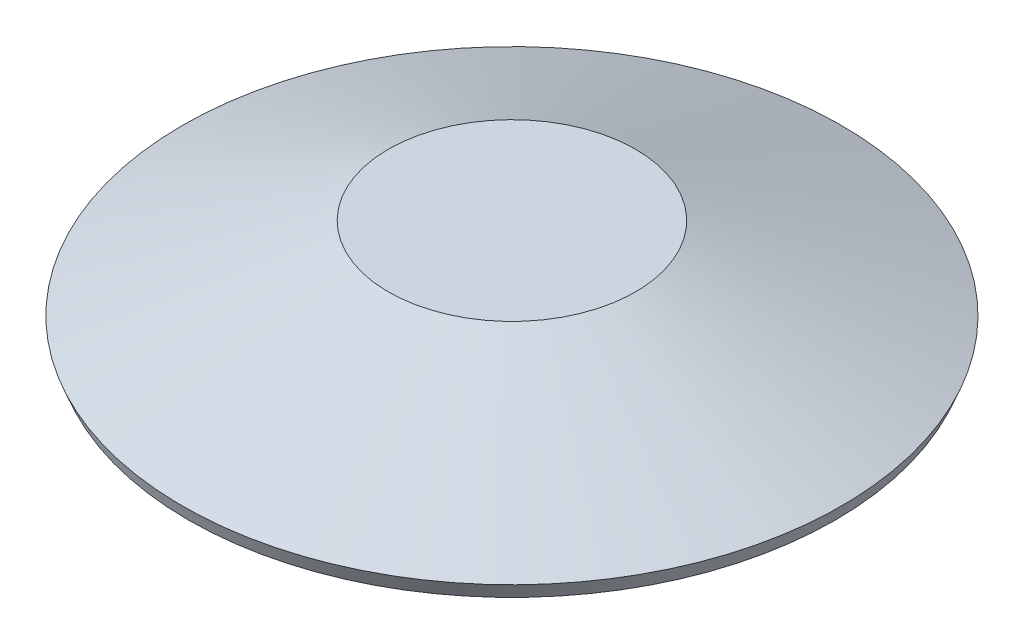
ISO-10303-21;
HEADER;
FILE_DESCRIPTION(('STEP AP214'),'2;1');
FILE_NAME('part.step','',(''),(''),'','','');
FILE_SCHEMA(('AUTOMOTIVE_DESIGN { 1 0 10303 214 1 1 1 1 }'));
ENDSEC;
DATA;
#1=APPLICATION_CONTEXT('core data for automotive mechanical design processes');
#2=APPLICATION_PROTOCOL_DEFINITION('international standard','automotive_design',2000,#1);
#3=PRODUCT_CONTEXT('',#1,'mechanical');
#4=PRODUCT('Part','Part','',(#3));
#5=PRODUCT_RELATED_PRODUCT_CATEGORY('part','',(#4));
#6=PRODUCT_DEFINITION_FORMATION('','',#4);
#7=PRODUCT_DEFINITION_CONTEXT('part definition',#1,'design');
#8=PRODUCT_DEFINITION('design','',#6,#7);
#9=PRODUCT_DEFINITION_SHAPE('','',#8);
#10=(LENGTH_UNIT() NAMED_UNIT(*) SI_UNIT(.MILLI.,.METRE.));
#11=(NAMED_UNIT(*) PLANE_ANGLE_UNIT() SI_UNIT($,.RADIAN.));
#12=(NAMED_UNIT(*) SI_UNIT($,.STERADIAN.) SOLID_ANGLE_UNIT());
#13=UNCERTAINTY_MEASURE_WITH_UNIT(LENGTH_MEASURE(1.E-05),#10,'distance_accuracy_value','');
#14=(GEOMETRIC_REPRESENTATION_CONTEXT(3) GLOBAL_UNCERTAINTY_ASSIGNED_CONTEXT((#13)) GLOBAL_UNIT_ASSIGNED_CONTEXT((#10,
#11,#12)) REPRESENTATION_CONTEXT('',''));
#15=CARTESIAN_POINT('',(0.,0.,0.));
#16=DIRECTION('',(0.,0.,1.));
#17=DIRECTION('',(1.,0.,0.));
#18=AXIS2_PLACEMENT_3D('',#15,#16,#17);
#19=CARTESIAN_POINT('',(0.,1.6,0.));
#20=DIRECTION('',(0.,-1.,0.));
#21=DIRECTION('',(1.,0.,0.));
#22=AXIS2_PLACEMENT_3D('',#19,#20,#21);
#23=PLANE('',#22);
#24=CARTESIAN_POINT('',(0.,1.6,0.));
#25=DIRECTION('',(0.,1.,0.));
#26=DIRECTION('',(-1.,0.,0.));
#27=AXIS2_PLACEMENT_3D('',#24,#25,#26);
#28=CIRCLE('',#27,3.);
#29=CARTESIAN_POINT('',(-3.,1.6,0.));
#30=VERTEX_POINT('',#29);
#31=EDGE_CURVE('E75',#30,#30,#28,.T.);
#32=ORIENTED_EDGE('',*,*,#31,.T.);
#33=EDGE_LOOP('',(#32));
#34=FACE_BOUND('',#33,.T.);
#35=ADVANCED_FACE('F41',(#34),#23,.F.);
#36=CARTESIAN_POINT('',(0.,-3.7,0.));
#37=DIRECTION('',(0.,1.,0.));
#38=DIRECTION('',(-1.,0.,0.));
#39=AXIS2_PLACEMENT_3D('',#36,#37,#38);
#40=PLANE('',#39);
#41=CARTESIAN_POINT('',(0.,-3.7,0.));
#42=DIRECTION('',(0.,1.,0.));
#43=DIRECTION('',(-1.,0.,0.));
#44=AXIS2_PLACEMENT_3D('',#41,#42,#43);
#45=CIRCLE('',#44,1.);
#46=CARTESIAN_POINT('',(-1.,-3.7,0.));
#47=VERTEX_POINT('',#46);
#48=EDGE_CURVE('E10',#47,#47,#45,.T.);
#49=ORIENTED_EDGE('',*,*,#48,.F.);
#50=EDGE_LOOP('',(#49));
#51=FACE_BOUND('',#50,.T.);
#52=ADVANCED_FACE('F129',(#51),#40,.F.);
#53=CARTESIAN_POINT('',(0.,-0.155918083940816,0.));
#54=DIRECTION('',(0.,1.,0.));
#55=DIRECTION('',(-1.,0.,0.));
#56=AXIS2_PLACEMENT_3D('',#53,#54,#55);
#57=CYLINDRICAL_SURFACE('',#56,1.);
#58=CARTESIAN_POINT('',(0.,-3.3,0.));
#59=DIRECTION('',(0.,1.,0.));
#60=DIRECTION('',(-1.,0.,0.));
#61=AXIS2_PLACEMENT_3D('',#58,#59,#60);
#62=CIRCLE('',#61,1.);
#63=CARTESIAN_POINT('',(-1.,-3.3,0.));
#64=VERTEX_POINT('',#63);
#65=EDGE_CURVE('E47',#64,#64,#62,.T.);
#66=ORIENTED_EDGE('',*,*,#65,.F.);
#67=EDGE_LOOP('',(#66));
#68=FACE_BOUND('',#67,.T.);
#69=ORIENTED_EDGE('',*,*,#48,.T.);
#70=EDGE_LOOP('',(#69));
#71=FACE_BOUND('',#70,.T.);
#72=ADVANCED_FACE('F124',(#68,#71),#57,.T.);
#73=CARTESIAN_POINT('',(0.,-3.3,0.));
#74=DIRECTION('',(0.,1.,0.));
#75=DIRECTION('',(-1.,0.,0.));
#76=AXIS2_PLACEMENT_3D('',#73,#74,#75);
#77=CONICAL_SURFACE('',#76,1.,0.917970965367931);
#78=CARTESIAN_POINT('',(0.,-2.66296644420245,0.));
#79=DIRECTION('',(0.,1.,0.));
#80=DIRECTION('',(-1.,0.,0.));
#81=AXIS2_PLACEMENT_3D('',#78,#79,#80);
#82=CIRCLE('',#81,1.83308060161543);
#83=CARTESIAN_POINT('',(-1.83308060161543,-2.66296644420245,0.));
#84=VERTEX_POINT('',#83);
#85=EDGE_CURVE('E51',#84,#84,#82,.T.);
#86=ORIENTED_EDGE('',*,*,#85,.F.);
#87=EDGE_LOOP('',(#86));
#88=FACE_BOUND('',#87,.T.);
#89=ORIENTED_EDGE('',*,*,#65,.T.);
#90=EDGE_LOOP('',(#89));
#91=FACE_BOUND('',#90,.T.);
#92=ADVANCED_FACE('F119',(#88,#91),#77,.T.);
#93=CARTESIAN_POINT('',(0.,-2.3252,0.));
#94=DIRECTION('',(0.,1.,0.));
#95=DIRECTION('',(-1.,0.,0.));
#96=AXIS2_PLACEMENT_3D('',#93,#94,#95);
#97=TOROIDAL_SURFACE('',#96,1.5748,0.4252);
#98=CARTESIAN_POINT('',(0.,-1.9,0.));
#99=DIRECTION('',(0.,1.,0.));
#100=DIRECTION('',(-1.,0.,0.));
#101=AXIS2_PLACEMENT_3D('',#98,#99,#100);
#102=CIRCLE('',#101,1.5748);
#103=CARTESIAN_POINT('',(-1.5748,-1.9,0.));
#104=VERTEX_POINT('',#103);
#105=EDGE_CURVE('E55',#104,#104,#102,.T.);
#106=ORIENTED_EDGE('',*,*,#105,.F.);
#107=EDGE_LOOP('',(#106));
#108=FACE_BOUND('',#107,.T.);
#109=ORIENTED_EDGE('',*,*,#85,.T.);
#110=EDGE_LOOP('',(#109));
#111=FACE_BOUND('',#110,.T.);
#112=ADVANCED_FACE('F113',(#108,#111),#97,.T.);
#113=CARTESIAN_POINT('',(0.,-1.9,0.));
#114=DIRECTION('',(0.,1.,0.));
#115=DIRECTION('',(-1.,0.,0.));
#116=AXIS2_PLACEMENT_3D('',#113,#114,#115);
#117=CONICAL_SURFACE('',#116,1.5748,0.152542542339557);
#118=CARTESIAN_POINT('',(0.,0.,0.));
#119=DIRECTION('',(0.,1.,0.));
#120=DIRECTION('',(-1.,0.,0.));
#121=AXIS2_PLACEMENT_3D('',#118,#119,#120);
#122=CIRCLE('',#121,1.8669);
#123=CARTESIAN_POINT('',(-1.8669,0.,0.));
#124=VERTEX_POINT('',#123);
#125=EDGE_CURVE('E60',#124,#124,#122,.T.);
#126=ORIENTED_EDGE('',*,*,#125,.F.);
#127=EDGE_LOOP('',(#126));
#128=FACE_BOUND('',#127,.T.);
#129=ORIENTED_EDGE('',*,*,#105,.T.);
#130=EDGE_LOOP('',(#129));
#131=FACE_BOUND('',#130,.T.);
#132=ADVANCED_FACE('F107',(#128,#131),#117,.T.);
#133=CARTESIAN_POINT('',(2.5,0.,0.));
#134=DIRECTION('',(0.,1.,0.));
#135=DIRECTION('',(-1.,0.,0.));
#136=AXIS2_PLACEMENT_3D('',#133,#134,#135);
#137=PLANE('',#136);
#138=CARTESIAN_POINT('',(0.,0.,0.));
#139=DIRECTION('',(0.,1.,0.));
#140=DIRECTION('',(-1.,0.,0.));
#141=AXIS2_PLACEMENT_3D('',#138,#139,#140);
#142=CIRCLE('',#141,2.5);
#143=CARTESIAN_POINT('',(-2.5,0.,0.));
#144=VERTEX_POINT('',#143);
#145=EDGE_CURVE('E63',#144,#144,#142,.T.);
#146=ORIENTED_EDGE('',*,*,#145,.F.);
#147=EDGE_LOOP('',(#146));
#148=FACE_BOUND('',#147,.T.);
#149=ORIENTED_EDGE('',*,*,#125,.T.);
#150=EDGE_LOOP('',(#149));
#151=FACE_BOUND('',#150,.T.);
#152=ADVANCED_FACE('F101',(#148,#151),#137,.F.);
#153=CARTESIAN_POINT('',(0.,-0.155918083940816,0.));
#154=DIRECTION('',(0.,1.,0.));
#155=DIRECTION('',(-1.,0.,0.));
#156=AXIS2_PLACEMENT_3D('',#153,#154,#155);
#157=CYLINDRICAL_SURFACE('',#156,2.5);
#158=CARTESIAN_POINT('',(0.,0.5,0.));
#159=DIRECTION('',(0.,1.,0.));
#160=DIRECTION('',(-1.,0.,0.));
#161=AXIS2_PLACEMENT_3D('',#158,#159,#160);
#162=CIRCLE('',#161,2.5);
#163=CARTESIAN_POINT('',(2.5,0.5,0.));
#164=VERTEX_POINT('',#163);
#165=EDGE_CURVE('E66',#164,#164,#162,.T.);
#166=ORIENTED_EDGE('',*,*,#165,.F.);
#167=EDGE_LOOP('',(#166));
#168=FACE_BOUND('',#167,.T.);
#169=ORIENTED_EDGE('',*,*,#145,.T.);
#170=EDGE_LOOP('',(#169));
#171=FACE_BOUND('',#170,.T.);
#172=ADVANCED_FACE('F95',(#168,#171),#157,.T.);
#173=CARTESIAN_POINT('',(0.,0.5,0.));
#174=DIRECTION('',(0.,-1.,0.));
#175=DIRECTION('',(1.,0.,0.));
#176=AXIS2_PLACEMENT_3D('',#173,#174,#175);
#177=CONICAL_SURFACE('',#176,2.5,1.33754174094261);
#178=CARTESIAN_POINT('',(0.,-0.771390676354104,0.));
#179=DIRECTION('',(0.,1.,0.));
#180=DIRECTION('',(-1.,0.,0.));
#181=AXIS2_PLACEMENT_3D('',#178,#179,#180);
#182=CIRCLE('',#181,7.85144372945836);
#183=CARTESIAN_POINT('',(7.85144372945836,-0.771390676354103,0.));
#184=VERTEX_POINT('',#183);
#185=EDGE_CURVE('E69',#184,#184,#182,.T.);
#186=CARTESIAN_POINT('',(7.85144372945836,-0.771390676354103,0.));
#187=CARTESIAN_POINT('',(7.79569952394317,-0.758147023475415,0.));
#188=CARTESIAN_POINT('',(7.73995531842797,-0.744903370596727,0.));
#189=CARTESIAN_POINT('',(7.62846690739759,-0.718416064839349,0.));
#190=CARTESIAN_POINT('',(7.5727227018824,-0.70517241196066,0.));
#191=CARTESIAN_POINT('',(7.46123429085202,-0.678685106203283,0.));
#192=CARTESIAN_POINT('',(7.40549008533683,-0.665441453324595,0.));
#193=CARTESIAN_POINT('',(7.29400167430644,-0.638954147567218,0.));
#194=CARTESIAN_POINT('',(7.23825746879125,-0.625710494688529,0.));
#195=CARTESIAN_POINT('',(7.12676905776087,-0.599223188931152,0.));
#196=CARTESIAN_POINT('',(7.07102485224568,-0.585979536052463,0.));
#197=CARTESIAN_POINT('',(6.9595364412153,-0.559492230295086,0.));
#198=CARTESIAN_POINT('',(6.90379223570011,-0.546248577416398,0.));
#199=CARTESIAN_POINT('',(6.79230382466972,-0.51976127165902,0.));
#200=CARTESIAN_POINT('',(6.73655961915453,-0.506517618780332,0.));
#201=CARTESIAN_POINT('',(6.62507120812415,-0.480030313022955,0.));
#202=CARTESIAN_POINT('',(6.56932700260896,-0.466786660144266,0.));
#203=CARTESIAN_POINT('',(6.45783859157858,-0.440299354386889,0.));
#204=CARTESIAN_POINT('',(6.40209438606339,-0.4270557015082,0.));
#205=CARTESIAN_POINT('',(6.290605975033,-0.400568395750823,0.));
#206=CARTESIAN_POINT('',(6.23486176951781,-0.387324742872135,0.));
#207=CARTESIAN_POINT('',(6.12337335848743,-0.360837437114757,0.));
#208=CARTESIAN_POINT('',(6.06762915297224,-0.347593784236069,0.));
#209=CARTESIAN_POINT('',(5.95614074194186,-0.321106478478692,0.));
#210=CARTESIAN_POINT('',(5.90039653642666,-0.307862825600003,0.));
#211=CARTESIAN_POINT('',(5.78890812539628,-0.281375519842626,0.));
#212=CARTESIAN_POINT('',(5.73316391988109,-0.268131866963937,0.));
#213=CARTESIAN_POINT('',(5.62167550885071,-0.24164456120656,0.));
#214=CARTESIAN_POINT('',(5.56593130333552,-0.228400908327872,0.));
#215=CARTESIAN_POINT('',(5.45444289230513,-0.201913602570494,0.));
#216=CARTESIAN_POINT('',(5.39869868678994,-0.188669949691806,0.));
#217=CARTESIAN_POINT('',(5.28721027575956,-0.162182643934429,0.));
#218=CARTESIAN_POINT('',(5.23146607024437,-0.14893899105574,0.));
#219=CARTESIAN_POINT('',(5.11997765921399,-0.122451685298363,0.));
#220=CARTESIAN_POINT('',(5.0642334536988,-0.109208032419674,0.));
#221=CARTESIAN_POINT('',(4.95274504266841,-0.0827207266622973,0.));
#222=CARTESIAN_POINT('',(4.89700083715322,-0.0694770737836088,0.));
#223=CARTESIAN_POINT('',(4.78551242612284,-0.0429897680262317,0.));
#224=CARTESIAN_POINT('',(4.72976822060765,-0.0297461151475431,0.));
#225=CARTESIAN_POINT('',(4.61827980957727,-0.00325880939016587,0.));
#226=CARTESIAN_POINT('',(4.56253560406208,0.00998484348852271,0.));
#227=CARTESIAN_POINT('',(4.45104719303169,0.0364721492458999,0.));
#228=CARTESIAN_POINT('',(4.3953029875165,0.0497158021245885,0.));
#229=CARTESIAN_POINT('',(4.28381457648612,0.0762031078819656,0.));
#230=CARTESIAN_POINT('',(4.22807037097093,0.0894467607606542,0.));
#231=CARTESIAN_POINT('',(4.11658195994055,0.115934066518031,0.));
#232=CARTESIAN_POINT('',(4.06083775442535,0.12917771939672,0.));
#233=CARTESIAN_POINT('',(3.94934934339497,0.155665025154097,0.));
#234=CARTESIAN_POINT('',(3.89360513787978,0.168908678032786,0.));
#235=CARTESIAN_POINT('',(3.7821167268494,0.195395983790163,0.));
#236=CARTESIAN_POINT('',(3.72637252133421,0.208639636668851,0.));
#237=CARTESIAN_POINT('',(3.61488411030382,0.235126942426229,0.));
#238=CARTESIAN_POINT('',(3.55913990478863,0.248370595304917,0.));
#239=CARTESIAN_POINT('',(3.44765149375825,0.274857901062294,0.));
#240=CARTESIAN_POINT('',(3.39190728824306,0.288101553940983,0.));
#241=CARTESIAN_POINT('',(3.28041887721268,0.31458885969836,0.));
#242=CARTESIAN_POINT('',(3.22467467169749,0.327832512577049,0.));
#243=CARTESIAN_POINT('',(3.1131862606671,0.354319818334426,0.));
#244=CARTESIAN_POINT('',(3.05744205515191,0.367563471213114,0.));
#245=CARTESIAN_POINT('',(2.94595364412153,0.394050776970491,0.));
#246=CARTESIAN_POINT('',(2.89020943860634,0.40729442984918,0.));
#247=CARTESIAN_POINT('',(2.77872102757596,0.433781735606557,0.));
#248=CARTESIAN_POINT('',(2.72297682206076,0.447025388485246,0.));
#249=CARTESIAN_POINT('',(2.61148841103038,0.473512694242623,0.));
#250=CARTESIAN_POINT('',(2.55574420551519,0.486756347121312,0.));
#251=CARTESIAN_POINT('',(2.5,0.5,0.));
#252=B_SPLINE_CURVE_WITH_KNOTS('',3,(#186,#187,#188,#189,#190,#191,#192,#193,#194,#195,#196,
#197,#198,#199,#200,#201,#202,#203,#204,#205,#206,#207,#208,#209,#210,#211,#212,#213,#214,#215,
#216,#217,#218,#219,#220,#221,#222,#223,#224,#225,#226,#227,#228,#229,#230,#231,#232,#233,#234,
#235,#236,#237,#238,#239,#240,#241,#242,#243,#244,#245,#246,#247,#248,#249,#250,#251),
.UNSPECIFIED.,.F.,.F.,(4,2,2,2,2,2,2,2,2,2,2,2,2,2,2,2,2,2,2,2,2,2,2,2,2,2,2,2,2,2,2,2,4),(0.,
0.171887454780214,0.343774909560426,0.51566236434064,0.687549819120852,0.859437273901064,
1.03132472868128,1.20321218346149,1.3750996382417,1.54698709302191,1.71887454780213,
1.89076200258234,2.06264945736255,2.23453691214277,2.40642436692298,2.57831182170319,
2.7501992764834,2.92208673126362,3.09397418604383,3.26586164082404,3.43774909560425,
3.60963655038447,3.78152400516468,3.95341145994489,4.1252989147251,4.29718636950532,
4.46907382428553,4.64096127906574,4.81284873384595,4.98473618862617,5.15662364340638,
5.32851109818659,5.5003985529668),.UNSPECIFIED.);
#253=EDGE_CURVE('BSEAM89',#184,#164,#252,.T.);
#254=ORIENTED_EDGE('',*,*,#185,.F.);
#255=ORIENTED_EDGE('',*,*,#165,.T.);
#256=ORIENTED_EDGE('',*,*,#253,.T.);
#257=ORIENTED_EDGE('',*,*,#253,.F.);
#258=EDGE_LOOP('',(#254,#256,#255,#257));
#259=FACE_BOUND('',#258,.T.);
#260=ADVANCED_FACE('F89',(#259),#177,.F.);
#261=CARTESIAN_POINT('',(0.,-0.771390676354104,0.));
#262=DIRECTION('',(0.,1.,0.));
#263=DIRECTION('',(-1.,0.,0.));
#264=AXIS2_PLACEMENT_3D('',#261,#262,#263);
#265=CONICAL_SURFACE('',#264,7.85144372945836,0.380506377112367);
#266=CARTESIAN_POINT('',(0.,-0.400000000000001,0.));
#267=DIRECTION('',(0.,1.,0.));
#268=DIRECTION('',(-1.,0.,0.));
#269=AXIS2_PLACEMENT_3D('',#266,#267,#268);
#270=CIRCLE('',#269,8.);
#271=CARTESIAN_POINT('',(-8.,-0.400000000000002,0.));
#272=VERTEX_POINT('',#271);
#273=EDGE_CURVE('E72',#272,#272,#270,.T.);
#274=ORIENTED_EDGE('',*,*,#273,.F.);
#275=EDGE_LOOP('',(#274));
#276=FACE_BOUND('',#275,.T.);
#277=ORIENTED_EDGE('',*,*,#185,.T.);
#278=EDGE_LOOP('',(#277));
#279=FACE_BOUND('',#278,.T.);
#280=ADVANCED_FACE('F83',(#276,#279),#265,.T.);
#281=CARTESIAN_POINT('',(0.,-0.400000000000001,0.));
#282=DIRECTION('',(0.,-1.,0.));
#283=DIRECTION('',(1.,0.,0.));
#284=AXIS2_PLACEMENT_3D('',#281,#282,#283);
#285=CONICAL_SURFACE('',#284,8.,1.19028994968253);
#286=ORIENTED_EDGE('',*,*,#31,.F.);
#287=EDGE_LOOP('',(#286));
#288=FACE_BOUND('',#287,.T.);
#289=ORIENTED_EDGE('',*,*,#273,.T.);
#290=EDGE_LOOP('',(#289));
#291=FACE_BOUND('',#290,.T.);
#292=ADVANCED_FACE('F80',(#288,#291),#285,.T.);
#293=CLOSED_SHELL('',(#35,#52,#72,#92,#112,#132,#152,#172,#260,#280,#292));
#294=MANIFOLD_SOLID_BREP('B2',#293);
#295=ADVANCED_BREP_SHAPE_REPRESENTATION('',(#18,#294),#14);
#296=SHAPE_DEFINITION_REPRESENTATION(#9,#295);
ENDSEC;
END-ISO-10303-21;
